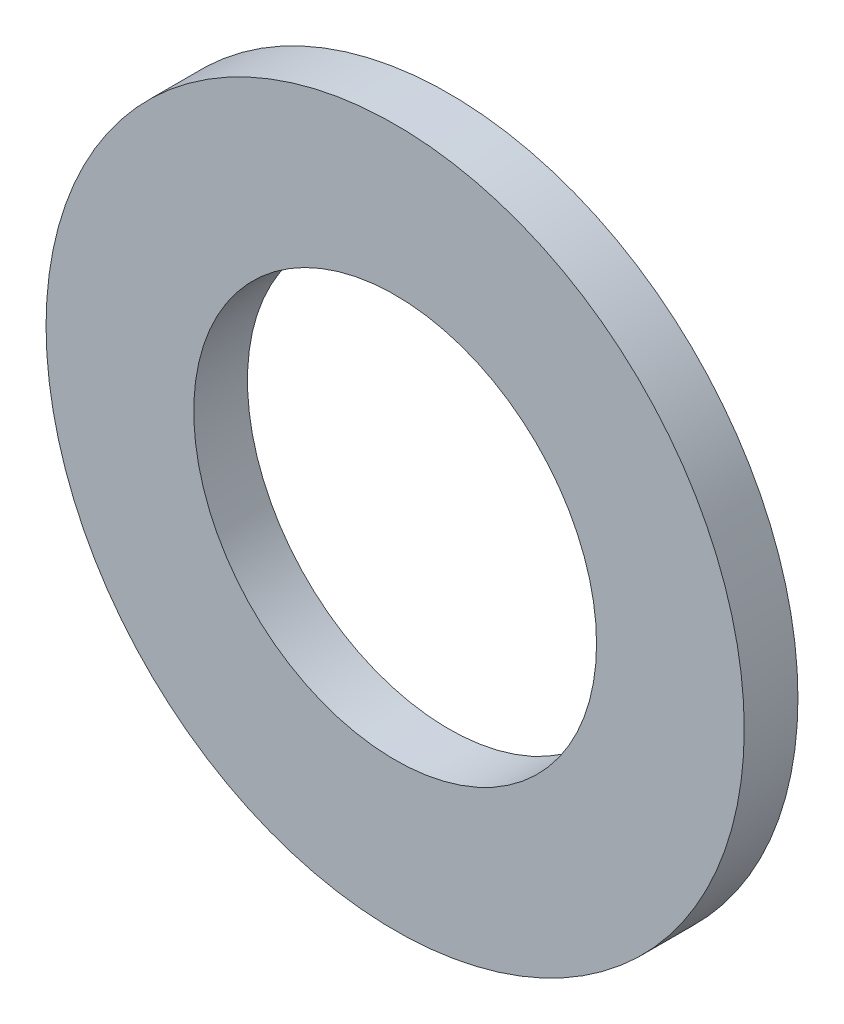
ISO-10303-21;
HEADER;
FILE_DESCRIPTION(('STEP AP214'),'2;1');
FILE_NAME('part.step','',(''),(''),'','','');
FILE_SCHEMA(('AUTOMOTIVE_DESIGN { 1 0 10303 214 1 1 1 1 }'));
ENDSEC;
DATA;
#1=APPLICATION_CONTEXT('core data for automotive mechanical design processes');
#2=APPLICATION_PROTOCOL_DEFINITION('international standard','automotive_design',2000,#1);
#3=PRODUCT_CONTEXT('',#1,'mechanical');
#4=PRODUCT('Part','Part','',(#3));
#5=PRODUCT_RELATED_PRODUCT_CATEGORY('part','',(#4));
#6=PRODUCT_DEFINITION_FORMATION('','',#4);
#7=PRODUCT_DEFINITION_CONTEXT('part definition',#1,'design');
#8=PRODUCT_DEFINITION('design','',#6,#7);
#9=PRODUCT_DEFINITION_SHAPE('','',#8);
#10=(LENGTH_UNIT() NAMED_UNIT(*) SI_UNIT(.MILLI.,.METRE.));
#11=(NAMED_UNIT(*) PLANE_ANGLE_UNIT() SI_UNIT($,.RADIAN.));
#12=(NAMED_UNIT(*) SI_UNIT($,.STERADIAN.) SOLID_ANGLE_UNIT());
#13=UNCERTAINTY_MEASURE_WITH_UNIT(LENGTH_MEASURE(1.E-05),#10,'distance_accuracy_value','');
#14=(GEOMETRIC_REPRESENTATION_CONTEXT(3) GLOBAL_UNCERTAINTY_ASSIGNED_CONTEXT((#13)) GLOBAL_UNIT_ASSIGNED_CONTEXT((#10,
#11,#12)) REPRESENTATION_CONTEXT('',''));
#15=CARTESIAN_POINT('',(0.,0.,0.));
#16=DIRECTION('',(0.,0.,1.));
#17=DIRECTION('',(1.,0.,0.));
#18=AXIS2_PLACEMENT_3D('',#15,#16,#17);
#19=CARTESIAN_POINT('',(0.,0.,4.));
#20=DIRECTION('',(0.,0.,1.));
#21=DIRECTION('',(1.,0.,0.));
#22=AXIS2_PLACEMENT_3D('',#19,#20,#21);
#23=PLANE('',#22);
#24=CARTESIAN_POINT('',(0.,0.,4.));
#25=DIRECTION('',(0.,0.,1.));
#26=DIRECTION('',(1.,0.,0.));
#27=AXIS2_PLACEMENT_3D('',#24,#25,#26);
#28=CIRCLE('',#27,26.);
#29=CARTESIAN_POINT('',(26.,0.,4.));
#30=VERTEX_POINT('',#29);
#31=EDGE_CURVE('E10',#30,#30,#28,.T.);
#32=ORIENTED_EDGE('',*,*,#31,.T.);
#33=EDGE_LOOP('',(#32));
#34=FACE_BOUND('',#33,.T.);
#35=CARTESIAN_POINT('',(0.,0.,4.));
#36=DIRECTION('',(0.,0.,1.));
#37=DIRECTION('',(1.,0.,0.));
#38=AXIS2_PLACEMENT_3D('',#35,#36,#37);
#39=CIRCLE('',#38,15.);
#40=CARTESIAN_POINT('',(15.,0.,4.));
#41=VERTEX_POINT('',#40);
#42=EDGE_CURVE('E40',#41,#41,#39,.T.);
#43=ORIENTED_EDGE('',*,*,#42,.F.);
#44=EDGE_LOOP('',(#43));
#45=FACE_BOUND('',#44,.T.);
#46=ADVANCED_FACE('F29',(#34,#45),#23,.T.);
#47=CARTESIAN_POINT('',(0.,0.,0.));
#48=DIRECTION('',(0.,0.,1.));
#49=DIRECTION('',(1.,0.,0.));
#50=AXIS2_PLACEMENT_3D('',#47,#48,#49);
#51=PLANE('',#50);
#52=CARTESIAN_POINT('',(0.,0.,0.));
#53=DIRECTION('',(0.,0.,1.));
#54=DIRECTION('',(1.,0.,0.));
#55=AXIS2_PLACEMENT_3D('',#52,#53,#54);
#56=CIRCLE('',#55,26.);
#57=CARTESIAN_POINT('',(26.,0.,0.));
#58=VERTEX_POINT('',#57);
#59=EDGE_CURVE('E36',#58,#58,#56,.T.);
#60=ORIENTED_EDGE('',*,*,#59,.F.);
#61=EDGE_LOOP('',(#60));
#62=FACE_BOUND('',#61,.T.);
#63=CARTESIAN_POINT('',(0.,0.,0.));
#64=DIRECTION('',(0.,0.,1.));
#65=DIRECTION('',(1.,0.,0.));
#66=AXIS2_PLACEMENT_3D('',#63,#64,#65);
#67=CIRCLE('',#66,15.);
#68=CARTESIAN_POINT('',(15.,0.,0.));
#69=VERTEX_POINT('',#68);
#70=EDGE_CURVE('E44',#69,#69,#67,.T.);
#71=ORIENTED_EDGE('',*,*,#70,.T.);
#72=EDGE_LOOP('',(#71));
#73=FACE_BOUND('',#72,.T.);
#74=ADVANCED_FACE('F50',(#62,#73),#51,.F.);
#75=CARTESIAN_POINT('',(0.,0.,4.));
#76=DIRECTION('',(0.,0.,-1.));
#77=DIRECTION('',(-1.,0.,0.));
#78=AXIS2_PLACEMENT_3D('',#75,#76,#77);
#79=CYLINDRICAL_SURFACE('',#78,26.);
#80=ORIENTED_EDGE('',*,*,#31,.F.);
#81=EDGE_LOOP('',(#80));
#82=FACE_BOUND('',#81,.T.);
#83=ORIENTED_EDGE('',*,*,#59,.T.);
#84=EDGE_LOOP('',(#83));
#85=FACE_BOUND('',#84,.T.);
#86=ADVANCED_FACE('F31',(#82,#85),#79,.T.);
#87=CARTESIAN_POINT('',(0.,0.,4.));
#88=DIRECTION('',(0.,0.,-1.));
#89=DIRECTION('',(-1.,0.,0.));
#90=AXIS2_PLACEMENT_3D('',#87,#88,#89);
#91=CYLINDRICAL_SURFACE('',#90,15.);
#92=ORIENTED_EDGE('',*,*,#42,.T.);
#93=EDGE_LOOP('',(#92));
#94=FACE_BOUND('',#93,.T.);
#95=ORIENTED_EDGE('',*,*,#70,.F.);
#96=EDGE_LOOP('',(#95));
#97=FACE_BOUND('',#96,.T.);
#98=ADVANCED_FACE('F52',(#94,#97),#91,.F.);
#99=CLOSED_SHELL('',(#46,#74,#86,#98));
#100=MANIFOLD_SOLID_BREP('B2',#99);
#101=ADVANCED_BREP_SHAPE_REPRESENTATION('',(#18,#100),#14);
#102=SHAPE_DEFINITION_REPRESENTATION(#9,#101);
ENDSEC;
END-ISO-10303-21;
